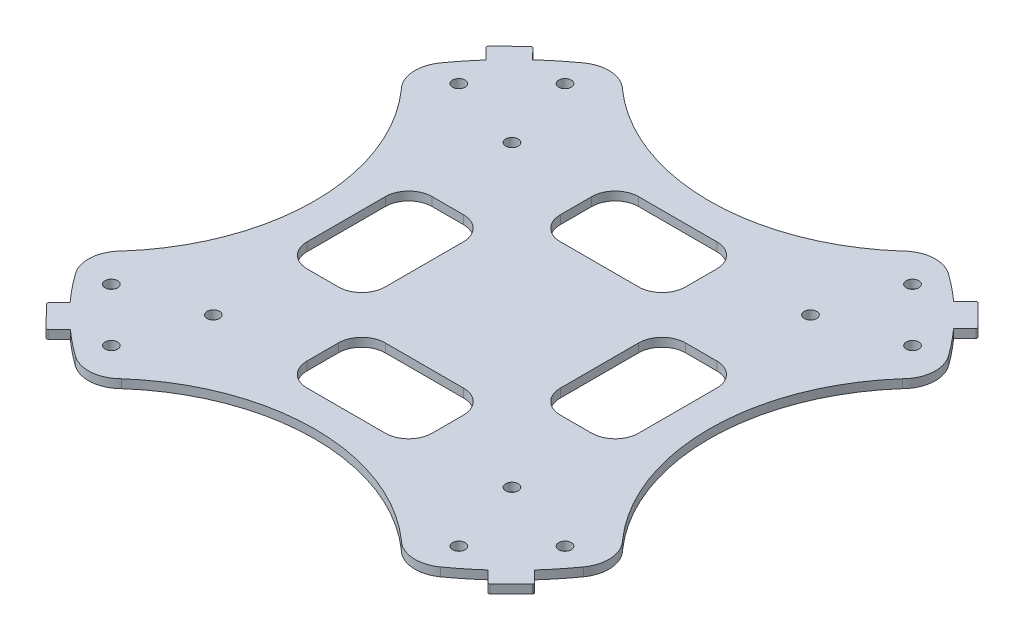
from build123d import *

# Parameters (mm, degrees)
SKETCH1_R           = 1.015999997
SKETCH1_R_2         = 1.015999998
BOSS_EXTRUDE1_DEPTH = 1.397
CUT_EXTRUDE1_DEPTH  = 1.397


with BuildPart() as part:
    # Sketch1 → Boss-Extrude1 (new body)
    with BuildSketch(Plane(origin=(0, 0, 0), x_dir=(1, 0, 0), z_dir=(0, 1, 0))):
        with BuildLine():
            Line((39.582900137, 36.114993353), (36.135807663, 39.558338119))
            ThreePointArc((36.135807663, 39.558338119), (35.957741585, 39.627761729), (35.781684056, 39.553391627))
            Line((35.781684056, 39.553391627), (33.985632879, 37.75734045))
            ThreePointArc((33.985632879, 37.75734045), (31.864995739, 39.563392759), (29.648553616, 41.25049416))
            ThreePointArc((29.648553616, 41.25049416), (26.08463695, 42.240855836), (22.7274362, 40.687948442))
            ThreePointArc((22.7274362, 40.687948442), (0, 32.054645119), (-22.7274362, 40.687948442))
            ThreePointArc((-22.7274362, 40.687948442), (-26.08463695, 42.240855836), (-29.648553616, 41.25049416))
            ThreePointArc((-29.648553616, 41.25049416), (-31.979190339, 39.471146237), (-34.203281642, 37.560291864))
            Line((-34.203281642, 37.560291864), (-35.891842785, 39.288069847))
            ThreePointArc((-35.891842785, 39.288069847), (-36.070582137, 39.364521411), (-36.251029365, 39.292193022))
            Line((-36.251029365, 39.292193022), (-39.722106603, 35.899901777))
            ThreePointArc((-39.722106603, 35.899901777), (-39.798570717, 35.719704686), (-39.724180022, 35.538641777))
            Line((-39.724180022, 35.538641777), (-37.952779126, 33.76724088))
            ThreePointArc((-37.952779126, 33.76724088), (-39.65514495, 31.750739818), (-41.25049416, 29.648553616))
            ThreePointArc((-41.25049416, 29.648553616), (-42.240855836, 26.08463695), (-40.687948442, 22.7274362))
            ThreePointArc((-40.687948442, 22.7274362), (-32.054645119, 0), (-40.687948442, -22.7274362))
            ThreePointArc((-40.687948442, -22.7274362), (-42.240855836, -26.08463695), (-41.25049416, -29.648553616))
            ThreePointArc((-41.25049416, -29.648553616), (-39.491481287, -31.954074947), (-37.603777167, -34.155467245))
            Line((-37.603777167, -34.155467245), (-39.342333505, -35.894023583))
            ThreePointArc((-39.342333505, -35.894023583), (-39.416724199, -36.072170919), (-39.34438326, -36.251160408))
            Line((-39.34438326, -36.251160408), (-35.996846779, -39.67644344))
            ThreePointArc((-35.996846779, -39.67644344), (-35.8116648, -39.777312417), (-35.614113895, -39.703552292))
            Line((-35.614113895, -39.703552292), (-33.818062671, -37.907501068))
            ThreePointArc((-33.818062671, -37.907501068), (-31.777299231, -39.633864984), (-29.648553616, -41.25049416))
            ThreePointArc((-29.648553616, -41.25049416), (-26.08463695, -42.240855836), (-22.7274362, -40.687948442))
            ThreePointArc((-22.7274362, -40.687948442), (0, -32.054645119), (22.7274362, -40.687948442))
            ThreePointArc((22.7274362, -40.687948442), (26.08463695, -42.240855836), (29.648553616, -41.25049416))
            ThreePointArc((29.648553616, -41.25049416), (31.839816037, -39.583659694), (33.937557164, -37.800558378))
            Line((33.937557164, -37.800558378), (35.712874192, -39.617107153))
            ThreePointArc((35.712874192, -39.617107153), (35.89865706, -39.693541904), (36.081857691, -39.611109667))
            Line((36.081857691, -39.611109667), (39.53818925, -36.154778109))
            ThreePointArc((39.53818925, -36.154778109), (39.581113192, -35.9880354), (39.507835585, -35.832227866))
            Line((39.507835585, -35.832227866), (37.71178436, -34.036176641))
            ThreePointArc((37.71178436, -34.036176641), (39.542043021, -31.891485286), (41.25049416, -29.648553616))
            ThreePointArc((41.25049416, -29.648553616), (42.240855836, -26.08463695), (40.687948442, -22.7274362))
            ThreePointArc((40.687948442, -22.7274362), (32.054645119, 0), (40.687948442, 22.7274362))
            ThreePointArc((40.687948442, 22.7274362), (42.240855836, 26.08463695), (41.25049416, 29.648553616))
            ThreePointArc((41.25049416, 29.648553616), (39.563392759, 31.864995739), (37.75734045, 33.985632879))
            Line((37.75734045, 33.985632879), (39.573889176, 35.76094986))
            ThreePointArc((39.573889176, 35.76094986), (39.650275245, 35.936142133), (39.582900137, 36.114993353))
        make_face()
        with Locations(Location((-28.220170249, 36.841216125, 0), (0, 0, 270))):
            Circle(SKETCH1_R, mode=Mode.SUBTRACT)
        with Locations(Location((-36.841216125, 28.220170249, 0), (0, 0, 90))):
            Circle(SKETCH1_R, mode=Mode.SUBTRACT)
        with Locations(Location((-24.24546392, 24.24546392, 0), (0, 0, 270))):
            Circle(SKETCH1_R_2, mode=Mode.SUBTRACT)
        with Locations(Location((28.220170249, 36.841216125, 0), (0, 0, 90))):
            Circle(SKETCH1_R, mode=Mode.SUBTRACT)
        with Locations(Location((36.841216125, 28.220170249, 0), (0, 0, 270))):
            Circle(SKETCH1_R, mode=Mode.SUBTRACT)
        with Locations(Location((24.24546392, 24.24546392, 0), (0, 0, 270))):
            Circle(SKETCH1_R_2, mode=Mode.SUBTRACT)
        with Locations(Location((36.841216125, -28.220170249, 0), (0, 0, 90))):
            Circle(SKETCH1_R, mode=Mode.SUBTRACT)
        with Locations(Location((28.220170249, -36.841216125, 0), (0, 0, 270))):
            Circle(SKETCH1_R, mode=Mode.SUBTRACT)
        with Locations(Location((24.24546392, -24.24546392, 0), (0, 0, 270))):
            Circle(SKETCH1_R_2, mode=Mode.SUBTRACT)
        with Locations(Location((-28.220170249, -36.841216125, 0), (0, 0, 90))):
            Circle(SKETCH1_R, mode=Mode.SUBTRACT)
        with Locations(Location((-36.841216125, -28.220170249, 0), (0, 0, 270))):
            Circle(SKETCH1_R, mode=Mode.SUBTRACT)
        with Locations(Location((-24.24546392, -24.24546392, 0), (0, 0, 270))):
            Circle(SKETCH1_R_2, mode=Mode.SUBTRACT)
    extrude(amount=BOSS_EXTRUDE1_DEPTH)

    # Sketch3 → Cut-Extrude1 (cut)
    with BuildSketch(Plane(origin=(0, 1.397, 0), x_dir=(1, 0, 0), z_dir=(0, 1, 0))):
        with BuildLine():
            Line((26.924, 6.35), (26.924, -6.35))
            ThreePointArc((26.924, -6.35), (25.808076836, -9.044076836), (23.114, -10.16))
            Line((23.114, -10.16), (18.034, -10.16))
            ThreePointArc((18.034, -10.16), (15.339923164, -9.044076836), (14.224, -6.35))
            Line((14.224, -6.35), (14.224, 6.35))
            ThreePointArc((14.224, 6.35), (15.339923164, 9.044076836), (18.034, 10.16))
            Line((18.034, 10.16), (23.114, 10.16))
            ThreePointArc((23.114, 10.16), (25.808076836, 9.044076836), (26.924, 6.35))
        make_face()
        with BuildLine():
            Line((-6.35, 26.924), (6.35, 26.924))
            ThreePointArc((6.35, 26.924), (9.044076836, 25.808076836), (10.16, 23.114))
            Line((10.16, 23.114), (10.16, 18.034))
            ThreePointArc((10.16, 18.034), (9.044076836, 15.339923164), (6.35, 14.224))
            Line((6.35, 14.224), (-6.35, 14.224))
            ThreePointArc((-6.35, 14.224), (-9.044076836, 15.339923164), (-10.16, 18.034))
            Line((-10.16, 18.034), (-10.16, 23.114))
            ThreePointArc((-10.16, 23.114), (-9.044076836, 25.808076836), (-6.35, 26.924))
        make_face()
        with BuildLine():
            Line((6.35, -26.924), (-6.35, -26.924))
            ThreePointArc((-6.35, -26.924), (-9.044076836, -25.808076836), (-10.16, -23.114))
            Line((-10.16, -23.114), (-10.16, -18.034))
            ThreePointArc((-10.16, -18.034), (-9.044076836, -15.339923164), (-6.35, -14.224))
            Line((-6.35, -14.224), (6.35, -14.224))
            ThreePointArc((6.35, -14.224), (9.044076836, -15.339923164), (10.16, -18.034))
            Line((10.16, -18.034), (10.16, -23.114))
            ThreePointArc((10.16, -23.114), (9.044076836, -25.808076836), (6.35, -26.924))
        make_face()
        with BuildLine():
            Line((-26.924, -6.35), (-26.924, 6.35))
            ThreePointArc((-26.924, 6.35), (-25.808076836, 9.044076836), (-23.114, 10.16))
            Line((-23.114, 10.16), (-18.034, 10.16))
            ThreePointArc((-18.034, 10.16), (-15.339923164, 9.044076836), (-14.224, 6.35))
            Line((-14.224, 6.35), (-14.224, -6.35))
            ThreePointArc((-14.224, -6.35), (-15.339923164, -9.044076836), (-18.034, -10.16))
            Line((-18.034, -10.16), (-23.114, -10.16))
            ThreePointArc((-23.114, -10.16), (-25.808076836, -9.044076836), (-26.924, -6.35))
        make_face()
    extrude(amount=-CUT_EXTRUDE1_DEPTH, mode=Mode.SUBTRACT)


solid = part.part
